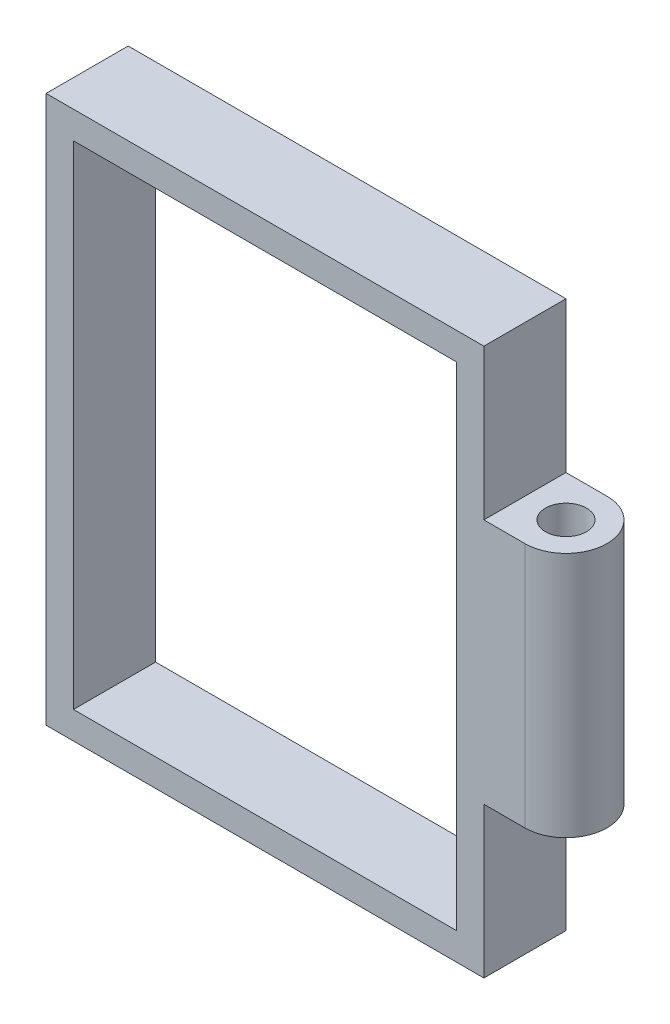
ISO-10303-21;
HEADER;
FILE_DESCRIPTION(('STEP AP214'),'2;1');
FILE_NAME('part.step','',(''),(''),'','','');
FILE_SCHEMA(('AUTOMOTIVE_DESIGN { 1 0 10303 214 1 1 1 1 }'));
ENDSEC;
DATA;
#1=APPLICATION_CONTEXT('core data for automotive mechanical design processes');
#2=APPLICATION_PROTOCOL_DEFINITION('international standard','automotive_design',2000,#1);
#3=PRODUCT_CONTEXT('',#1,'mechanical');
#4=PRODUCT('Part','Part','',(#3));
#5=PRODUCT_RELATED_PRODUCT_CATEGORY('part','',(#4));
#6=PRODUCT_DEFINITION_FORMATION('','',#4);
#7=PRODUCT_DEFINITION_CONTEXT('part definition',#1,'design');
#8=PRODUCT_DEFINITION('design','',#6,#7);
#9=PRODUCT_DEFINITION_SHAPE('','',#8);
#10=(LENGTH_UNIT() NAMED_UNIT(*) SI_UNIT(.MILLI.,.METRE.));
#11=(NAMED_UNIT(*) PLANE_ANGLE_UNIT() SI_UNIT($,.RADIAN.));
#12=(NAMED_UNIT(*) SI_UNIT($,.STERADIAN.) SOLID_ANGLE_UNIT());
#13=UNCERTAINTY_MEASURE_WITH_UNIT(LENGTH_MEASURE(1.E-05),#10,'distance_accuracy_value','');
#14=(GEOMETRIC_REPRESENTATION_CONTEXT(3) GLOBAL_UNCERTAINTY_ASSIGNED_CONTEXT((#13)) GLOBAL_UNIT_ASSIGNED_CONTEXT((#10,
#11,#12)) REPRESENTATION_CONTEXT('',''));
#15=CARTESIAN_POINT('',(0.,0.,0.));
#16=DIRECTION('',(0.,0.,1.));
#17=DIRECTION('',(1.,0.,0.));
#18=AXIS2_PLACEMENT_3D('',#15,#16,#17);
#19=CARTESIAN_POINT('',(8.,20.,1.5));
#20=DIRECTION('',(-1.,0.,0.));
#21=DIRECTION('',(0.,0.,1.));
#22=AXIS2_PLACEMENT_3D('',#19,#20,#21);
#23=PLANE('',#22);
#24=DIRECTION('',(0.,0.,1.));
#25=VECTOR('',#24,1.);
#26=CARTESIAN_POINT('',(8.,14.5,-1.5));
#27=LINE('',#26,#25);
#28=CARTESIAN_POINT('',(8.,14.5,-1.5));
#29=VERTEX_POINT('',#28);
#30=CARTESIAN_POINT('',(8.,14.5,1.5));
#31=VERTEX_POINT('',#30);
#32=EDGE_CURVE('E187',#29,#31,#27,.T.);
#33=ORIENTED_EDGE('',*,*,#32,.F.);
#34=DIRECTION('',(0.,-1.,0.));
#35=VECTOR('',#34,1.);
#36=CARTESIAN_POINT('',(8.,20.,-1.5));
#37=LINE('',#36,#35);
#38=CARTESIAN_POINT('',(8.,20.,-1.5));
#39=VERTEX_POINT('',#38);
#40=EDGE_CURVE('E11',#39,#29,#37,.T.);
#41=ORIENTED_EDGE('',*,*,#40,.F.);
#42=DIRECTION('',(0.,0.,-1.));
#43=VECTOR('',#42,1.);
#44=CARTESIAN_POINT('',(8.,20.,1.5));
#45=LINE('',#44,#43);
#46=CARTESIAN_POINT('',(8.,20.,1.5));
#47=VERTEX_POINT('',#46);
#48=EDGE_CURVE('E225',#47,#39,#45,.T.);
#49=ORIENTED_EDGE('',*,*,#48,.F.);
#50=DIRECTION('',(0.,-1.,0.));
#51=VECTOR('',#50,1.);
#52=CARTESIAN_POINT('',(8.,20.,1.5));
#53=LINE('',#52,#51);
#54=EDGE_CURVE('E252',#47,#31,#53,.T.);
#55=ORIENTED_EDGE('',*,*,#54,.T.);
#56=EDGE_LOOP('',(#33,#41,#49,#55));
#57=FACE_BOUND('',#56,.T.);
#58=ADVANCED_FACE('F43',(#57),#23,.F.);
#59=CARTESIAN_POINT('',(8.,5.5,-1.5));
#60=VERTEX_POINT('',#59);
#61=CARTESIAN_POINT('',(8.,0.,-1.5));
#62=VERTEX_POINT('',#61);
#63=EDGE_CURVE('E52',#60,#62,#37,.T.);
#64=ORIENTED_EDGE('',*,*,#63,.F.);
#65=DIRECTION('',(0.,0.,1.));
#66=VECTOR('',#65,1.);
#67=CARTESIAN_POINT('',(8.,5.5,-1.5));
#68=LINE('',#67,#66);
#69=CARTESIAN_POINT('',(8.,5.5,1.5));
#70=VERTEX_POINT('',#69);
#71=EDGE_CURVE('E206',#60,#70,#68,.T.);
#72=ORIENTED_EDGE('',*,*,#71,.T.);
#73=CARTESIAN_POINT('',(8.,0.,1.5));
#74=VERTEX_POINT('',#73);
#75=EDGE_CURVE('E239',#70,#74,#53,.T.);
#76=ORIENTED_EDGE('',*,*,#75,.T.);
#77=DIRECTION('',(0.,0.,-1.));
#78=VECTOR('',#77,1.);
#79=CARTESIAN_POINT('',(8.,0.,1.5));
#80=LINE('',#79,#78);
#81=EDGE_CURVE('E222',#74,#62,#80,.T.);
#82=ORIENTED_EDGE('',*,*,#81,.T.);
#83=EDGE_LOOP('',(#64,#72,#76,#82));
#84=FACE_BOUND('',#83,.T.);
#85=ADVANCED_FACE('F45',(#84),#23,.F.);
#86=CARTESIAN_POINT('',(-8.,20.,-1.5));
#87=DIRECTION('',(0.,0.,1.));
#88=DIRECTION('',(1.,0.,0.));
#89=AXIS2_PLACEMENT_3D('',#86,#87,#88);
#90=PLANE('',#89);
#91=DIRECTION('',(-1.,0.,0.));
#92=VECTOR('',#91,1.);
#93=CARTESIAN_POINT('',(-7.,0.999999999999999,-1.5));
#94=LINE('',#93,#92);
#95=CARTESIAN_POINT('',(7.,0.999999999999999,-1.5));
#96=VERTEX_POINT('',#95);
#97=CARTESIAN_POINT('',(-7.,0.999999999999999,-1.5));
#98=VERTEX_POINT('',#97);
#99=EDGE_CURVE('E155',#96,#98,#94,.T.);
#100=ORIENTED_EDGE('',*,*,#99,.F.);
#101=DIRECTION('',(0.,-1.,0.));
#102=VECTOR('',#101,1.);
#103=CARTESIAN_POINT('',(7.,0.999999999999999,-1.5));
#104=LINE('',#103,#102);
#105=CARTESIAN_POINT('',(7.,19.,-1.5));
#106=VERTEX_POINT('',#105);
#107=EDGE_CURVE('E135',#106,#96,#104,.T.);
#108=ORIENTED_EDGE('',*,*,#107,.F.);
#109=DIRECTION('',(1.,0.,0.));
#110=VECTOR('',#109,1.);
#111=CARTESIAN_POINT('',(-7.,19.,-1.5));
#112=LINE('',#111,#110);
#113=CARTESIAN_POINT('',(-7.,19.,-1.5));
#114=VERTEX_POINT('',#113);
#115=EDGE_CURVE('E145',#114,#106,#112,.T.);
#116=ORIENTED_EDGE('',*,*,#115,.F.);
#117=DIRECTION('',(0.,1.,0.));
#118=VECTOR('',#117,1.);
#119=CARTESIAN_POINT('',(-7.,0.999999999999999,-1.5));
#120=LINE('',#119,#118);
#121=EDGE_CURVE('E59',#98,#114,#120,.T.);
#122=ORIENTED_EDGE('',*,*,#121,.F.);
#123=EDGE_LOOP('',(#100,#108,#116,#122));
#124=FACE_BOUND('',#123,.T.);
#125=DIRECTION('',(-1.,0.,0.));
#126=VECTOR('',#125,1.);
#127=CARTESIAN_POINT('',(-8.,0.,-1.5));
#128=LINE('',#127,#126);
#129=CARTESIAN_POINT('',(-8.,0.,-1.5));
#130=VERTEX_POINT('',#129);
#131=EDGE_CURVE('E243',#62,#130,#128,.T.);
#132=ORIENTED_EDGE('',*,*,#131,.T.);
#133=DIRECTION('',(0.,-1.,0.));
#134=VECTOR('',#133,1.);
#135=CARTESIAN_POINT('',(-8.,20.,-1.5));
#136=LINE('',#135,#134);
#137=CARTESIAN_POINT('',(-8.,20.,-1.5));
#138=VERTEX_POINT('',#137);
#139=EDGE_CURVE('E259',#138,#130,#136,.T.);
#140=ORIENTED_EDGE('',*,*,#139,.F.);
#141=DIRECTION('',(-1.,0.,0.));
#142=VECTOR('',#141,1.);
#143=CARTESIAN_POINT('',(-8.,20.,-1.5));
#144=LINE('',#143,#142);
#145=EDGE_CURVE('E229',#39,#138,#144,.T.);
#146=ORIENTED_EDGE('',*,*,#145,.F.);
#147=ORIENTED_EDGE('',*,*,#40,.T.);
#148=DIRECTION('',(-1.,0.,0.));
#149=VECTOR('',#148,1.);
#150=CARTESIAN_POINT('',(8.,14.5,-1.5));
#151=LINE('',#150,#149);
#152=CARTESIAN_POINT('',(9.5,14.5,-1.5));
#153=VERTEX_POINT('',#152);
#154=EDGE_CURVE('E184',#153,#29,#151,.T.);
#155=ORIENTED_EDGE('',*,*,#154,.F.);
#156=DIRECTION('',(0.,1.,0.));
#157=VECTOR('',#156,1.);
#158=CARTESIAN_POINT('',(9.5,5.5,-1.5));
#159=LINE('',#158,#157);
#160=CARTESIAN_POINT('',(9.5,5.5,-1.5));
#161=VERTEX_POINT('',#160);
#162=EDGE_CURVE('E219',#161,#153,#159,.T.);
#163=ORIENTED_EDGE('',*,*,#162,.F.);
#164=DIRECTION('',(-1.,0.,0.));
#165=VECTOR('',#164,1.);
#166=CARTESIAN_POINT('',(8.,5.5,-1.5));
#167=LINE('',#166,#165);
#168=EDGE_CURVE('E202',#161,#60,#167,.T.);
#169=ORIENTED_EDGE('',*,*,#168,.T.);
#170=ORIENTED_EDGE('',*,*,#63,.T.);
#171=EDGE_LOOP('',(#132,#140,#146,#147,#155,#163,#169,#170));
#172=FACE_BOUND('',#171,.T.);
#173=ADVANCED_FACE('F152',(#124,#172),#90,.F.);
#174=CARTESIAN_POINT('',(-8.,20.,1.5));
#175=DIRECTION('',(1.,0.,0.));
#176=DIRECTION('',(0.,0.,-1.));
#177=AXIS2_PLACEMENT_3D('',#174,#175,#176);
#178=PLANE('',#177);
#179=DIRECTION('',(0.,0.,1.));
#180=VECTOR('',#179,1.);
#181=CARTESIAN_POINT('',(-8.,0.,1.5));
#182=LINE('',#181,#180);
#183=CARTESIAN_POINT('',(-8.,0.,1.5));
#184=VERTEX_POINT('',#183);
#185=EDGE_CURVE('E246',#130,#184,#182,.T.);
#186=ORIENTED_EDGE('',*,*,#185,.T.);
#187=DIRECTION('',(0.,-1.,0.));
#188=VECTOR('',#187,1.);
#189=CARTESIAN_POINT('',(-8.,20.,1.5));
#190=LINE('',#189,#188);
#191=CARTESIAN_POINT('',(-8.,20.,1.5));
#192=VERTEX_POINT('',#191);
#193=EDGE_CURVE('E256',#192,#184,#190,.T.);
#194=ORIENTED_EDGE('',*,*,#193,.F.);
#195=DIRECTION('',(0.,0.,1.));
#196=VECTOR('',#195,1.);
#197=CARTESIAN_POINT('',(-8.,20.,1.5));
#198=LINE('',#197,#196);
#199=EDGE_CURVE('E233',#138,#192,#198,.T.);
#200=ORIENTED_EDGE('',*,*,#199,.F.);
#201=ORIENTED_EDGE('',*,*,#139,.T.);
#202=EDGE_LOOP('',(#186,#194,#200,#201));
#203=FACE_BOUND('',#202,.T.);
#204=ADVANCED_FACE('F282',(#203),#178,.F.);
#205=CARTESIAN_POINT('',(-8.,20.,1.5));
#206=DIRECTION('',(0.,0.,-1.));
#207=DIRECTION('',(-1.,0.,0.));
#208=AXIS2_PLACEMENT_3D('',#205,#206,#207);
#209=PLANE('',#208);
#210=DIRECTION('',(-1.,0.,0.));
#211=VECTOR('',#210,1.);
#212=CARTESIAN_POINT('',(-7.,19.,1.5));
#213=LINE('',#212,#211);
#214=CARTESIAN_POINT('',(7.,19.,1.5));
#215=VERTEX_POINT('',#214);
#216=CARTESIAN_POINT('',(-7.,19.,1.5));
#217=VERTEX_POINT('',#216);
#218=EDGE_CURVE('E160',#215,#217,#213,.T.);
#219=ORIENTED_EDGE('',*,*,#218,.F.);
#220=DIRECTION('',(0.,1.,0.));
#221=VECTOR('',#220,1.);
#222=CARTESIAN_POINT('',(7.,0.999999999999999,1.5));
#223=LINE('',#222,#221);
#224=CARTESIAN_POINT('',(7.,0.999999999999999,1.5));
#225=VERTEX_POINT('',#224);
#226=EDGE_CURVE('E67',#225,#215,#223,.T.);
#227=ORIENTED_EDGE('',*,*,#226,.F.);
#228=DIRECTION('',(1.,0.,0.));
#229=VECTOR('',#228,1.);
#230=CARTESIAN_POINT('',(-7.,0.999999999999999,1.5));
#231=LINE('',#230,#229);
#232=CARTESIAN_POINT('',(-7.,0.999999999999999,1.5));
#233=VERTEX_POINT('',#232);
#234=EDGE_CURVE('E142',#233,#225,#231,.T.);
#235=ORIENTED_EDGE('',*,*,#234,.F.);
#236=DIRECTION('',(0.,-1.,0.));
#237=VECTOR('',#236,1.);
#238=CARTESIAN_POINT('',(-7.,0.999999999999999,1.5));
#239=LINE('',#238,#237);
#240=EDGE_CURVE('E167',#217,#233,#239,.T.);
#241=ORIENTED_EDGE('',*,*,#240,.F.);
#242=EDGE_LOOP('',(#219,#227,#235,#241));
#243=FACE_BOUND('',#242,.T.);
#244=DIRECTION('',(1.,0.,0.));
#245=VECTOR('',#244,1.);
#246=CARTESIAN_POINT('',(-8.,0.,1.5));
#247=LINE('',#246,#245);
#248=EDGE_CURVE('E230',#184,#74,#247,.T.);
#249=ORIENTED_EDGE('',*,*,#248,.T.);
#250=ORIENTED_EDGE('',*,*,#75,.F.);
#251=DIRECTION('',(1.,0.,0.));
#252=VECTOR('',#251,1.);
#253=CARTESIAN_POINT('',(8.,5.5,1.5));
#254=LINE('',#253,#252);
#255=CARTESIAN_POINT('',(9.5,5.5,1.5));
#256=VERTEX_POINT('',#255);
#257=EDGE_CURVE('E210',#70,#256,#254,.T.);
#258=ORIENTED_EDGE('',*,*,#257,.T.);
#259=DIRECTION('',(0.,1.,0.));
#260=VECTOR('',#259,1.);
#261=CARTESIAN_POINT('',(9.5,5.5,1.5));
#262=LINE('',#261,#260);
#263=CARTESIAN_POINT('',(9.5,14.5,1.5));
#264=VERTEX_POINT('',#263);
#265=EDGE_CURVE('E218',#256,#264,#262,.T.);
#266=ORIENTED_EDGE('',*,*,#265,.T.);
#267=DIRECTION('',(1.,0.,0.));
#268=VECTOR('',#267,1.);
#269=CARTESIAN_POINT('',(8.,14.5,1.5));
#270=LINE('',#269,#268);
#271=EDGE_CURVE('E190',#31,#264,#270,.T.);
#272=ORIENTED_EDGE('',*,*,#271,.F.);
#273=ORIENTED_EDGE('',*,*,#54,.F.);
#274=DIRECTION('',(1.,0.,0.));
#275=VECTOR('',#274,1.);
#276=CARTESIAN_POINT('',(-8.,20.,1.5));
#277=LINE('',#276,#275);
#278=EDGE_CURVE('E236',#192,#47,#277,.T.);
#279=ORIENTED_EDGE('',*,*,#278,.F.);
#280=ORIENTED_EDGE('',*,*,#193,.T.);
#281=EDGE_LOOP('',(#249,#250,#258,#266,#272,#273,#279,#280));
#282=FACE_BOUND('',#281,.T.);
#283=ADVANCED_FACE('F278',(#243,#282),#209,.F.);
#284=CARTESIAN_POINT('',(0.,20.,0.));
#285=DIRECTION('',(0.,-1.,0.));
#286=DIRECTION('',(0.,0.,-1.));
#287=AXIS2_PLACEMENT_3D('',#284,#285,#286);
#288=PLANE('',#287);
#289=ORIENTED_EDGE('',*,*,#48,.T.);
#290=ORIENTED_EDGE('',*,*,#145,.T.);
#291=ORIENTED_EDGE('',*,*,#199,.T.);
#292=ORIENTED_EDGE('',*,*,#278,.T.);
#293=EDGE_LOOP('',(#289,#290,#291,#292));
#294=FACE_BOUND('',#293,.T.);
#295=ADVANCED_FACE('F284',(#294),#288,.F.);
#296=CARTESIAN_POINT('',(0.,0.,0.));
#297=DIRECTION('',(0.,-1.,0.));
#298=DIRECTION('',(0.,0.,-1.));
#299=AXIS2_PLACEMENT_3D('',#296,#297,#298);
#300=PLANE('',#299);
#301=ORIENTED_EDGE('',*,*,#81,.F.);
#302=ORIENTED_EDGE('',*,*,#248,.F.);
#303=ORIENTED_EDGE('',*,*,#185,.F.);
#304=ORIENTED_EDGE('',*,*,#131,.F.);
#305=EDGE_LOOP('',(#301,#302,#303,#304));
#306=FACE_BOUND('',#305,.T.);
#307=ADVANCED_FACE('F273',(#306),#300,.T.);
#308=CARTESIAN_POINT('',(9.5,5.5,0.));
#309=DIRECTION('',(0.,1.,0.));
#310=DIRECTION('',(0.,0.,1.));
#311=AXIS2_PLACEMENT_3D('',#308,#309,#310);
#312=CYLINDRICAL_SURFACE('',#311,1.5);
#313=ORIENTED_EDGE('',*,*,#162,.T.);
#314=CARTESIAN_POINT('',(9.5,14.5,0.));
#315=DIRECTION('',(0.,1.,0.));
#316=DIRECTION('',(0.,0.,1.));
#317=AXIS2_PLACEMENT_3D('',#314,#315,#316);
#318=CIRCLE('',#317,1.5);
#319=EDGE_CURVE('E194',#264,#153,#318,.T.);
#320=ORIENTED_EDGE('',*,*,#319,.F.);
#321=ORIENTED_EDGE('',*,*,#265,.F.);
#322=CARTESIAN_POINT('',(9.5,5.5,0.));
#323=DIRECTION('',(0.,1.,0.));
#324=DIRECTION('',(0.,0.,1.));
#325=AXIS2_PLACEMENT_3D('',#322,#323,#324);
#326=CIRCLE('',#325,1.5);
#327=EDGE_CURVE('E214',#256,#161,#326,.T.);
#328=ORIENTED_EDGE('',*,*,#327,.T.);
#329=EDGE_LOOP('',(#313,#320,#321,#328));
#330=FACE_BOUND('',#329,.T.);
#331=ADVANCED_FACE('F297',(#330),#312,.T.);
#332=CARTESIAN_POINT('',(9.5,5.5,0.));
#333=DIRECTION('',(0.,1.,0.));
#334=DIRECTION('',(0.,0.,1.));
#335=AXIS2_PLACEMENT_3D('',#332,#333,#334);
#336=PLANE('',#335);
#337=CARTESIAN_POINT('',(9.5,5.5,0.));
#338=DIRECTION('',(0.,1.,0.));
#339=DIRECTION('',(0.,0.,1.));
#340=AXIS2_PLACEMENT_3D('',#337,#338,#339);
#341=CIRCLE('',#340,0.75);
#342=CARTESIAN_POINT('',(9.5,5.5,0.750000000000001));
#343=VERTEX_POINT('',#342);
#344=EDGE_CURVE('E198',#343,#343,#341,.T.);
#345=ORIENTED_EDGE('',*,*,#344,.T.);
#346=EDGE_LOOP('',(#345));
#347=FACE_BOUND('',#346,.T.);
#348=ORIENTED_EDGE('',*,*,#168,.F.);
#349=ORIENTED_EDGE('',*,*,#327,.F.);
#350=ORIENTED_EDGE('',*,*,#257,.F.);
#351=ORIENTED_EDGE('',*,*,#71,.F.);
#352=EDGE_LOOP('',(#348,#349,#350,#351));
#353=FACE_BOUND('',#352,.T.);
#354=ADVANCED_FACE('F299',(#347,#353),#336,.F.);
#355=CARTESIAN_POINT('',(9.5,5.5,0.));
#356=DIRECTION('',(0.,1.,0.));
#357=DIRECTION('',(0.,0.,1.));
#358=AXIS2_PLACEMENT_3D('',#355,#356,#357);
#359=CYLINDRICAL_SURFACE('',#358,0.75);
#360=ORIENTED_EDGE('',*,*,#344,.F.);
#361=EDGE_LOOP('',(#360));
#362=FACE_BOUND('',#361,.T.);
#363=CARTESIAN_POINT('',(9.5,14.5,0.));
#364=DIRECTION('',(0.,1.,0.));
#365=DIRECTION('',(0.,0.,1.));
#366=AXIS2_PLACEMENT_3D('',#363,#364,#365);
#367=CIRCLE('',#366,0.75);
#368=CARTESIAN_POINT('',(9.5,14.5,0.750000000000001));
#369=VERTEX_POINT('',#368);
#370=EDGE_CURVE('E149',#369,#369,#367,.T.);
#371=ORIENTED_EDGE('',*,*,#370,.T.);
#372=EDGE_LOOP('',(#371));
#373=FACE_BOUND('',#372,.T.);
#374=ADVANCED_FACE('F301',(#362,#373),#359,.F.);
#375=CARTESIAN_POINT('',(9.5,14.5,0.));
#376=DIRECTION('',(0.,1.,0.));
#377=DIRECTION('',(0.,0.,1.));
#378=AXIS2_PLACEMENT_3D('',#375,#376,#377);
#379=PLANE('',#378);
#380=ORIENTED_EDGE('',*,*,#154,.T.);
#381=ORIENTED_EDGE('',*,*,#32,.T.);
#382=ORIENTED_EDGE('',*,*,#271,.T.);
#383=ORIENTED_EDGE('',*,*,#319,.T.);
#384=EDGE_LOOP('',(#380,#381,#382,#383));
#385=FACE_BOUND('',#384,.T.);
#386=ORIENTED_EDGE('',*,*,#370,.F.);
#387=EDGE_LOOP('',(#386));
#388=FACE_BOUND('',#387,.T.);
#389=ADVANCED_FACE('F292',(#385,#388),#379,.T.);
#390=CARTESIAN_POINT('',(7.,0.999999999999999,-1.501));
#391=DIRECTION('',(1.,0.,0.));
#392=DIRECTION('',(0.,0.,-1.));
#393=AXIS2_PLACEMENT_3D('',#390,#391,#392);
#394=PLANE('',#393);
#395=ORIENTED_EDGE('',*,*,#107,.T.);
#396=DIRECTION('',(0.,0.,1.));
#397=VECTOR('',#396,1.);
#398=CARTESIAN_POINT('',(7.,0.999999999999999,-1.501));
#399=LINE('',#398,#397);
#400=EDGE_CURVE('E150',#96,#225,#399,.T.);
#401=ORIENTED_EDGE('',*,*,#400,.T.);
#402=ORIENTED_EDGE('',*,*,#226,.T.);
#403=DIRECTION('',(0.,0.,1.));
#404=VECTOR('',#403,1.);
#405=CARTESIAN_POINT('',(7.,19.,-1.501));
#406=LINE('',#405,#404);
#407=EDGE_CURVE('E131',#106,#215,#406,.T.);
#408=ORIENTED_EDGE('',*,*,#407,.F.);
#409=EDGE_LOOP('',(#395,#401,#402,#408));
#410=FACE_BOUND('',#409,.T.);
#411=ADVANCED_FACE('F133',(#410),#394,.F.);
#412=CARTESIAN_POINT('',(-7.,0.999999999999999,-1.501));
#413=DIRECTION('',(0.,-1.,0.));
#414=DIRECTION('',(0.,0.,-1.));
#415=AXIS2_PLACEMENT_3D('',#412,#413,#414);
#416=PLANE('',#415);
#417=ORIENTED_EDGE('',*,*,#99,.T.);
#418=DIRECTION('',(0.,0.,1.));
#419=VECTOR('',#418,1.);
#420=CARTESIAN_POINT('',(-7.,0.999999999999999,-1.501));
#421=LINE('',#420,#419);
#422=EDGE_CURVE('E176',#98,#233,#421,.T.);
#423=ORIENTED_EDGE('',*,*,#422,.T.);
#424=ORIENTED_EDGE('',*,*,#234,.T.);
#425=ORIENTED_EDGE('',*,*,#400,.F.);
#426=EDGE_LOOP('',(#417,#423,#424,#425));
#427=FACE_BOUND('',#426,.T.);
#428=ADVANCED_FACE('F386',(#427),#416,.F.);
#429=CARTESIAN_POINT('',(-7.,0.999999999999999,-1.501));
#430=DIRECTION('',(-1.,0.,0.));
#431=DIRECTION('',(0.,0.,1.));
#432=AXIS2_PLACEMENT_3D('',#429,#430,#431);
#433=PLANE('',#432);
#434=ORIENTED_EDGE('',*,*,#121,.T.);
#435=DIRECTION('',(0.,0.,1.));
#436=VECTOR('',#435,1.);
#437=CARTESIAN_POINT('',(-7.,19.,-1.501));
#438=LINE('',#437,#436);
#439=EDGE_CURVE('E141',#114,#217,#438,.T.);
#440=ORIENTED_EDGE('',*,*,#439,.T.);
#441=ORIENTED_EDGE('',*,*,#240,.T.);
#442=ORIENTED_EDGE('',*,*,#422,.F.);
#443=EDGE_LOOP('',(#434,#440,#441,#442));
#444=FACE_BOUND('',#443,.T.);
#445=ADVANCED_FACE('F396',(#444),#433,.F.);
#446=CARTESIAN_POINT('',(-7.,19.,-1.501));
#447=DIRECTION('',(0.,1.,0.));
#448=DIRECTION('',(0.,0.,1.));
#449=AXIS2_PLACEMENT_3D('',#446,#447,#448);
#450=PLANE('',#449);
#451=ORIENTED_EDGE('',*,*,#115,.T.);
#452=ORIENTED_EDGE('',*,*,#407,.T.);
#453=ORIENTED_EDGE('',*,*,#218,.T.);
#454=ORIENTED_EDGE('',*,*,#439,.F.);
#455=EDGE_LOOP('',(#451,#452,#453,#454));
#456=FACE_BOUND('',#455,.T.);
#457=ADVANCED_FACE('F146',(#456),#450,.F.);
#458=CLOSED_SHELL('',(#58,#85,#173,#204,#283,#295,#307,#331,#354,#374,#389,#411,#428,#445,#457));
#459=MANIFOLD_SOLID_BREP('B2',#458);
#460=ADVANCED_BREP_SHAPE_REPRESENTATION('',(#18,#459),#14);
#461=SHAPE_DEFINITION_REPRESENTATION(#9,#460);
ENDSEC;
END-ISO-10303-21;
